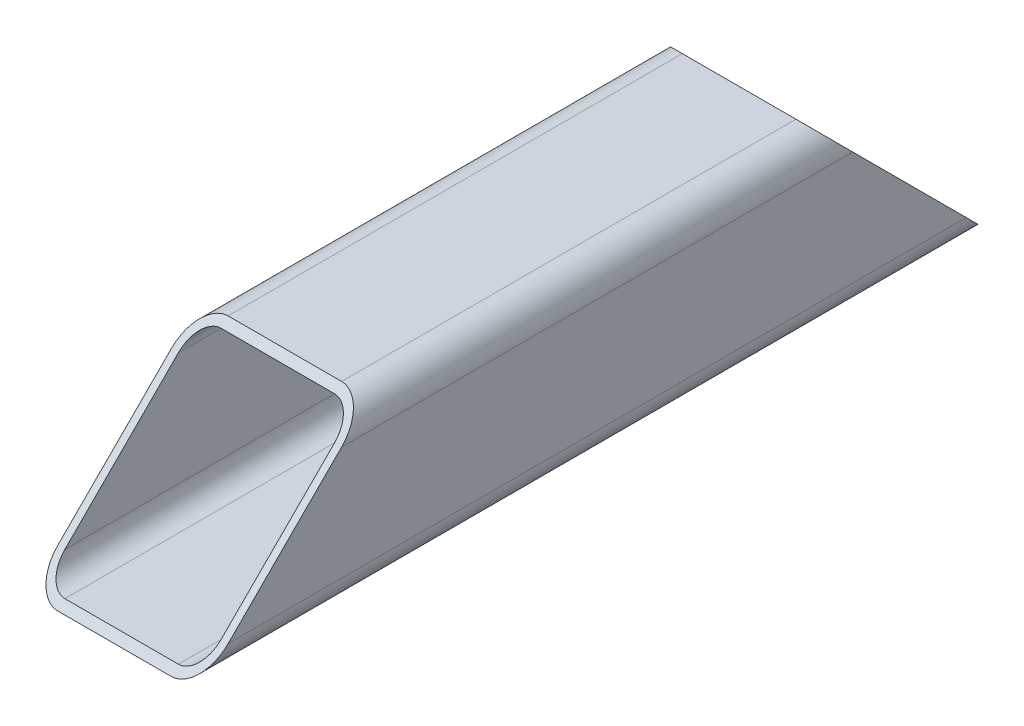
from build123d import *

# Parameters (mm, degrees)
BASE_EXTRUDE_THIN_DEPTH = 355.6
CUT_EXTRUDE1_DEPTH      = 366.662973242
CUT_EXTRUDE2_DEPTH      = 366.662973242


with BuildPart() as part:
    # Sketch1 → Base-Extrude-Thin (new body)
    with BuildSketch(Plane.XY):
        with BuildLine():
            Line((-25.4, 38.1), (25.4, 38.1))
            ThreePointArc((25.4, 38.1), (34.380256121, 34.380256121), (38.1, 25.4))
            Line((38.1, 25.4), (38.1, -25.4))
            ThreePointArc((38.1, -25.4), (34.380256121, -34.380256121), (25.4, -38.1))
            Line((25.4, -38.1), (-25.4, -38.1))
            ThreePointArc((-25.4, -38.1), (-34.380256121, -34.380256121), (-38.1, -25.4))
            Line((-38.1, -25.4), (-38.1, 25.4))
            ThreePointArc((-38.1, 25.4), (-34.380256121, 34.380256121), (-25.4, 38.1))
        make_face()
        with BuildLine():
            Line((-25.4, 34.925), (25.4, 34.925))
            ThreePointArc((25.4, 34.925), (32.135192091, 32.135192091), (34.925, 25.4))
            Line((34.925, 25.4), (34.925, -25.4))
            ThreePointArc((34.925, -25.4), (32.135192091, -32.135192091), (25.4, -34.925))
            Line((25.4, -34.925), (-25.4, -34.925))
            ThreePointArc((-25.4, -34.925), (-32.135192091, -32.135192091), (-34.925, -25.4))
            Line((-34.925, -25.4), (-34.925, 25.4))
            ThreePointArc((-34.925, 25.4), (-32.135192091, 32.135192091), (-25.4, 34.925))
        make_face(mode=Mode.SUBTRACT)
    extrude(amount=BASE_EXTRUDE_THIN_DEPTH)

    # Sketch2 → Cut-Extrude1 (cut, through all)
    with BuildSketch(Plane(origin=(38.1, 0, 0), x_dir=(0, 0, -1), z_dir=(1, 0, 0))):
        Polygon((-876.981868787, -559.481868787), (-355.6, -38.1), (-279.4, 38.1), (241.981868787, 559.481868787), (-800.781868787, 1602.245606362), (-1919.745606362, 483.281868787), align=None)
    extrude(amount=-CUT_EXTRUDE1_DEPTH, mode=Mode.SUBTRACT)

    # Sketch3 → Cut-Extrude2 (cut, through all)
    with BuildSketch(Plane(origin=(38.1, 0, 0), x_dir=(0, 0, -1), z_dir=(1, 0, 0))):
        Polygon((521.381868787, -559.481868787), (0, -38.1), (-76.2, 38.1), (-597.581868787, 559.481868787), (445.181868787, 1602.245606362), (1564.145606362, 483.281868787), align=None)
    extrude(amount=-CUT_EXTRUDE2_DEPTH, mode=Mode.SUBTRACT)


solid = part.part
